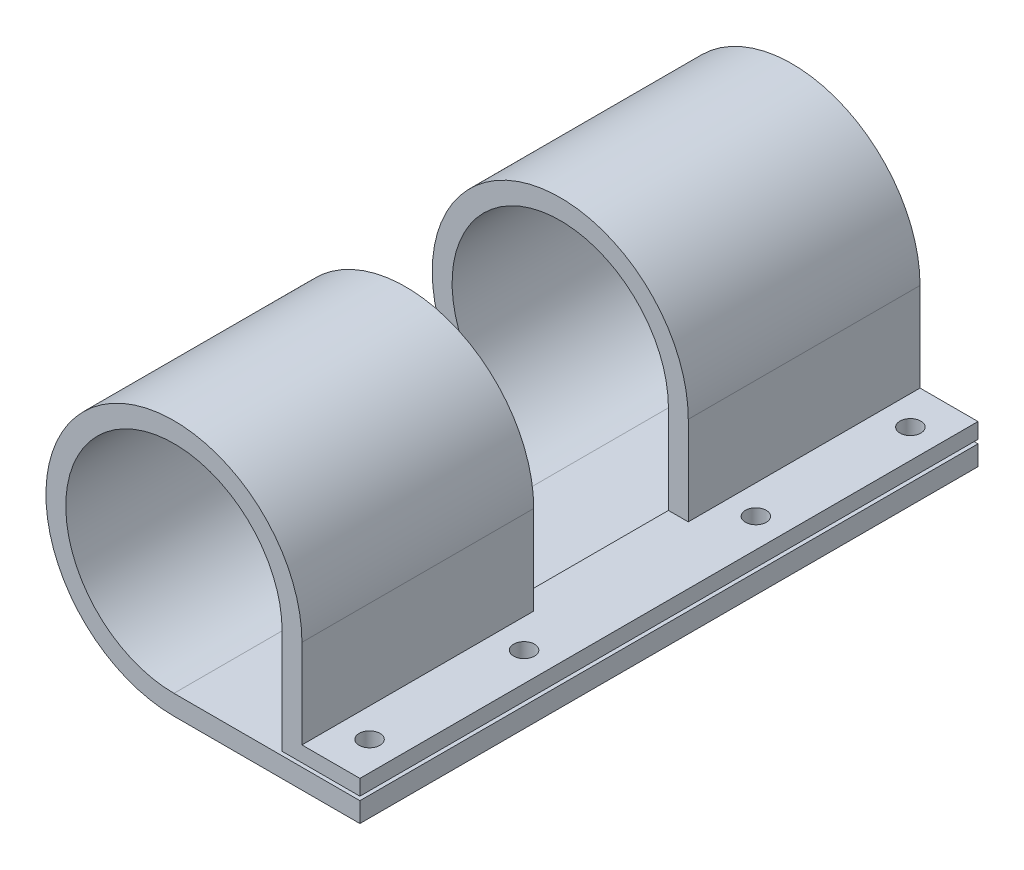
ISO-10303-21;
HEADER;
FILE_DESCRIPTION(('STEP AP214'),'2;1');
FILE_NAME('part.step','',(''),(''),'','','');
FILE_SCHEMA(('AUTOMOTIVE_DESIGN { 1 0 10303 214 1 1 1 1 }'));
ENDSEC;
DATA;
#1=APPLICATION_CONTEXT('core data for automotive mechanical design processes');
#2=APPLICATION_PROTOCOL_DEFINITION('international standard','automotive_design',2000,#1);
#3=PRODUCT_CONTEXT('',#1,'mechanical');
#4=PRODUCT('Part','Part','',(#3));
#5=PRODUCT_RELATED_PRODUCT_CATEGORY('part','',(#4));
#6=PRODUCT_DEFINITION_FORMATION('','',#4);
#7=PRODUCT_DEFINITION_CONTEXT('part definition',#1,'design');
#8=PRODUCT_DEFINITION('design','',#6,#7);
#9=PRODUCT_DEFINITION_SHAPE('','',#8);
#10=(LENGTH_UNIT() NAMED_UNIT(*) SI_UNIT(.MILLI.,.METRE.));
#11=(NAMED_UNIT(*) PLANE_ANGLE_UNIT() SI_UNIT($,.RADIAN.));
#12=(NAMED_UNIT(*) SI_UNIT($,.STERADIAN.) SOLID_ANGLE_UNIT());
#13=UNCERTAINTY_MEASURE_WITH_UNIT(LENGTH_MEASURE(1.E-05),#10,'distance_accuracy_value','');
#14=(GEOMETRIC_REPRESENTATION_CONTEXT(3) GLOBAL_UNCERTAINTY_ASSIGNED_CONTEXT((#13)) GLOBAL_UNIT_ASSIGNED_CONTEXT((#10,
#11,#12)) REPRESENTATION_CONTEXT('',''));
#15=CARTESIAN_POINT('',(0.,0.,0.));
#16=DIRECTION('',(0.,0.,1.));
#17=DIRECTION('',(1.,0.,0.));
#18=AXIS2_PLACEMENT_3D('',#15,#16,#17);
#19=CARTESIAN_POINT('',(21.04,0.,-50.8));
#20=DIRECTION('',(1.,0.,0.));
#21=DIRECTION('',(0.,1.,0.));
#22=AXIS2_PLACEMENT_3D('',#19,#20,#21);
#23=PLANE('',#22);
#24=DIRECTION('',(0.,0.,1.));
#25=VECTOR('',#24,1.);
#26=CARTESIAN_POINT('',(21.04,0.,-50.8));
#27=LINE('',#26,#25);
#28=CARTESIAN_POINT('',(21.04,0.,-50.8));
#29=VERTEX_POINT('',#28);
#30=CARTESIAN_POINT('',(21.04,0.,-12.7));
#31=VERTEX_POINT('',#30);
#32=EDGE_CURVE('E200',#29,#31,#27,.T.);
#33=ORIENTED_EDGE('',*,*,#32,.T.);
#34=DIRECTION('',(0.,-1.,0.));
#35=VECTOR('',#34,1.);
#36=CARTESIAN_POINT('',(21.04,14.605,-12.7));
#37=LINE('',#36,#35);
#38=CARTESIAN_POINT('',(21.04,-14.605,-12.7));
#39=VERTEX_POINT('',#38);
#40=EDGE_CURVE('E187',#31,#39,#37,.T.);
#41=ORIENTED_EDGE('',*,*,#40,.T.);
#42=DIRECTION('',(0.,0.,1.));
#43=VECTOR('',#42,1.);
#44=CARTESIAN_POINT('',(21.04,-14.605,-50.8));
#45=LINE('',#44,#43);
#46=CARTESIAN_POINT('',(21.04,-14.605,-50.8));
#47=VERTEX_POINT('',#46);
#48=EDGE_CURVE('E198',#47,#39,#45,.T.);
#49=ORIENTED_EDGE('',*,*,#48,.F.);
#50=DIRECTION('',(0.,1.,0.));
#51=VECTOR('',#50,1.);
#52=CARTESIAN_POINT('',(21.04,0.,-50.8));
#53=LINE('',#52,#51);
#54=EDGE_CURVE('E309',#47,#29,#53,.T.);
#55=ORIENTED_EDGE('',*,*,#54,.T.);
#56=EDGE_LOOP('',(#33,#41,#49,#55));
#57=FACE_BOUND('',#56,.T.);
#58=ADVANCED_FACE('F69',(#57),#23,.T.);
#59=CARTESIAN_POINT('',(17.78,-17.145,-50.8));
#60=DIRECTION('',(0.,-1.,0.));
#61=DIRECTION('',(0.,0.,-1.));
#62=AXIS2_PLACEMENT_3D('',#59,#60,#61);
#63=PLANE('',#62);
#64=CARTESIAN_POINT('',(25.8025,-17.145,-44.45));
#65=DIRECTION('',(0.,-1.,0.));
#66=DIRECTION('',(0.,0.,-1.));
#67=AXIS2_PLACEMENT_3D('',#64,#65,#66);
#68=CIRCLE('',#67,1.7145);
#69=CARTESIAN_POINT('',(25.8025,-17.145,-46.1645));
#70=VERTEX_POINT('',#69);
#71=EDGE_CURVE('E202',#70,#70,#68,.T.);
#72=ORIENTED_EDGE('',*,*,#71,.F.);
#73=EDGE_LOOP('',(#72));
#74=FACE_BOUND('',#73,.T.);
#75=CARTESIAN_POINT('',(25.8025,-17.145,19.05));
#76=DIRECTION('',(0.,-1.,0.));
#77=DIRECTION('',(0.,0.,-1.));
#78=AXIS2_PLACEMENT_3D('',#75,#76,#77);
#79=CIRCLE('',#78,1.7145);
#80=CARTESIAN_POINT('',(25.8025,-17.145,17.3355));
#81=VERTEX_POINT('',#80);
#82=EDGE_CURVE('E399',#81,#81,#79,.T.);
#83=ORIENTED_EDGE('',*,*,#82,.F.);
#84=EDGE_LOOP('',(#83));
#85=FACE_BOUND('',#84,.T.);
#86=CARTESIAN_POINT('',(25.8025,-17.145,44.45));
#87=DIRECTION('',(0.,-1.,0.));
#88=DIRECTION('',(0.,0.,-1.));
#89=AXIS2_PLACEMENT_3D('',#86,#87,#88);
#90=CIRCLE('',#89,1.7145);
#91=CARTESIAN_POINT('',(25.8025,-17.145,42.7355));
#92=VERTEX_POINT('',#91);
#93=EDGE_CURVE('E411',#92,#92,#90,.T.);
#94=ORIENTED_EDGE('',*,*,#93,.F.);
#95=EDGE_LOOP('',(#94));
#96=FACE_BOUND('',#95,.T.);
#97=CARTESIAN_POINT('',(25.8025,-17.145,-19.05));
#98=DIRECTION('',(0.,-1.,0.));
#99=DIRECTION('',(0.,0.,-1.));
#100=AXIS2_PLACEMENT_3D('',#97,#98,#99);
#101=CIRCLE('',#100,1.7145);
#102=CARTESIAN_POINT('',(25.8025,-17.145,-20.7645));
#103=VERTEX_POINT('',#102);
#104=EDGE_CURVE('E423',#103,#103,#101,.T.);
#105=ORIENTED_EDGE('',*,*,#104,.F.);
#106=EDGE_LOOP('',(#105));
#107=FACE_BOUND('',#106,.T.);
#108=DIRECTION('',(0.,0.,1.));
#109=VECTOR('',#108,1.);
#110=CARTESIAN_POINT('',(30.565,-17.145,-50.8));
#111=LINE('',#110,#109);
#112=CARTESIAN_POINT('',(30.565,-17.145,-50.8));
#113=VERTEX_POINT('',#112);
#114=CARTESIAN_POINT('',(30.565,-17.145,50.8));
#115=VERTEX_POINT('',#114);
#116=EDGE_CURVE('E73',#113,#115,#111,.T.);
#117=ORIENTED_EDGE('',*,*,#116,.T.);
#118=DIRECTION('',(1.,0.,0.));
#119=VECTOR('',#118,1.);
#120=CARTESIAN_POINT('',(17.78,-17.145,50.8));
#121=LINE('',#120,#119);
#122=CARTESIAN_POINT('',(17.78,-17.145,50.8));
#123=VERTEX_POINT('',#122);
#124=EDGE_CURVE('E336',#123,#115,#121,.T.);
#125=ORIENTED_EDGE('',*,*,#124,.F.);
#126=DIRECTION('',(0.,0.,1.));
#127=VECTOR('',#126,1.);
#128=CARTESIAN_POINT('',(17.78,-17.145,-50.8));
#129=LINE('',#128,#127);
#130=CARTESIAN_POINT('',(17.78,-17.145,-50.8));
#131=VERTEX_POINT('',#130);
#132=EDGE_CURVE('E12',#131,#123,#129,.T.);
#133=ORIENTED_EDGE('',*,*,#132,.F.);
#134=DIRECTION('',(1.,0.,0.));
#135=VECTOR('',#134,1.);
#136=CARTESIAN_POINT('',(17.78,-17.145,-50.8));
#137=LINE('',#136,#135);
#138=EDGE_CURVE('E301',#131,#113,#137,.T.);
#139=ORIENTED_EDGE('',*,*,#138,.T.);
#140=EDGE_LOOP('',(#117,#125,#133,#139));
#141=FACE_BOUND('',#140,.T.);
#142=ADVANCED_FACE('F71',(#74,#85,#96,#107,#141),#63,.T.);
#143=CARTESIAN_POINT('',(17.78,0.,-50.8));
#144=DIRECTION('',(-1.,0.,0.));
#145=DIRECTION('',(0.,-1.,0.));
#146=AXIS2_PLACEMENT_3D('',#143,#144,#145);
#147=PLANE('',#146);
#148=DIRECTION('',(0.,1.,0.));
#149=VECTOR('',#148,1.);
#150=CARTESIAN_POINT('',(17.78,0.,12.7));
#151=LINE('',#150,#149);
#152=CARTESIAN_POINT('',(17.78,-14.605,12.7));
#153=VERTEX_POINT('',#152);
#154=CARTESIAN_POINT('',(17.78,0.,12.7));
#155=VERTEX_POINT('',#154);
#156=EDGE_CURVE('E364',#153,#155,#151,.T.);
#157=ORIENTED_EDGE('',*,*,#156,.F.);
#158=DIRECTION('',(0.,0.,1.));
#159=VECTOR('',#158,1.);
#160=CARTESIAN_POINT('',(17.78,-14.605,-50.8));
#161=LINE('',#160,#159);
#162=CARTESIAN_POINT('',(17.78,-14.605,-12.7));
#163=VERTEX_POINT('',#162);
#164=EDGE_CURVE('E352',#163,#153,#161,.T.);
#165=ORIENTED_EDGE('',*,*,#164,.F.);
#166=DIRECTION('',(0.,1.,0.));
#167=VECTOR('',#166,1.);
#168=CARTESIAN_POINT('',(17.78,0.,-12.7));
#169=LINE('',#168,#167);
#170=CARTESIAN_POINT('',(17.78,0.,-12.7));
#171=VERTEX_POINT('',#170);
#172=EDGE_CURVE('E190',#163,#171,#169,.T.);
#173=ORIENTED_EDGE('',*,*,#172,.T.);
#174=DIRECTION('',(0.,0.,1.));
#175=VECTOR('',#174,1.);
#176=CARTESIAN_POINT('',(17.78,0.,-50.8));
#177=LINE('',#176,#175);
#178=CARTESIAN_POINT('',(17.78,0.,-50.8));
#179=VERTEX_POINT('',#178);
#180=EDGE_CURVE('E79',#179,#171,#177,.T.);
#181=ORIENTED_EDGE('',*,*,#180,.F.);
#182=DIRECTION('',(0.,-1.,0.));
#183=VECTOR('',#182,1.);
#184=CARTESIAN_POINT('',(17.78,0.,-50.8));
#185=LINE('',#184,#183);
#186=EDGE_CURVE('E223',#179,#131,#185,.T.);
#187=ORIENTED_EDGE('',*,*,#186,.T.);
#188=ORIENTED_EDGE('',*,*,#132,.T.);
#189=DIRECTION('',(0.,-1.,0.));
#190=VECTOR('',#189,1.);
#191=CARTESIAN_POINT('',(17.78,0.,50.8));
#192=LINE('',#191,#190);
#193=CARTESIAN_POINT('',(17.78,0.,50.8));
#194=VERTEX_POINT('',#193);
#195=EDGE_CURVE('E297',#194,#123,#192,.T.);
#196=ORIENTED_EDGE('',*,*,#195,.F.);
#197=EDGE_CURVE('E242',#155,#194,#177,.T.);
#198=ORIENTED_EDGE('',*,*,#197,.F.);
#199=EDGE_LOOP('',(#157,#165,#173,#181,#187,#188,#196,#198));
#200=FACE_BOUND('',#199,.T.);
#201=ADVANCED_FACE('F339',(#200),#147,.T.);
#202=CARTESIAN_POINT('',(0.,0.,-50.8));
#203=DIRECTION('',(0.,0.,1.));
#204=DIRECTION('',(1.,0.,0.));
#205=AXIS2_PLACEMENT_3D('',#202,#203,#204);
#206=CYLINDRICAL_SURFACE('',#205,17.78);
#207=CARTESIAN_POINT('',(0.,0.,12.7));
#208=DIRECTION('',(0.,0.,1.));
#209=DIRECTION('',(1.,0.,0.));
#210=AXIS2_PLACEMENT_3D('',#207,#208,#209);
#211=CIRCLE('',#210,17.78);
#212=CARTESIAN_POINT('',(-10.1401368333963,-14.605,12.7));
#213=VERTEX_POINT('',#212);
#214=EDGE_CURVE('E367',#155,#213,#211,.T.);
#215=ORIENTED_EDGE('',*,*,#214,.F.);
#216=ORIENTED_EDGE('',*,*,#197,.T.);
#217=CARTESIAN_POINT('',(0.,0.,50.8));
#218=DIRECTION('',(0.,0.,-1.));
#219=DIRECTION('',(1.,0.,0.));
#220=AXIS2_PLACEMENT_3D('',#217,#218,#219);
#221=CIRCLE('',#220,17.78);
#222=CARTESIAN_POINT('',(0.,-17.78,50.8));
#223=VERTEX_POINT('',#222);
#224=EDGE_CURVE('E293',#223,#194,#221,.T.);
#225=ORIENTED_EDGE('',*,*,#224,.F.);
#226=DIRECTION('',(0.,0.,1.));
#227=VECTOR('',#226,1.);
#228=CARTESIAN_POINT('',(0.,-17.78,-50.8));
#229=LINE('',#228,#227);
#230=CARTESIAN_POINT('',(0.,-17.78,-50.8));
#231=VERTEX_POINT('',#230);
#232=EDGE_CURVE('E243',#231,#223,#229,.T.);
#233=ORIENTED_EDGE('',*,*,#232,.F.);
#234=CARTESIAN_POINT('',(0.,0.,-50.8));
#235=DIRECTION('',(0.,0.,-1.));
#236=DIRECTION('',(1.,0.,0.));
#237=AXIS2_PLACEMENT_3D('',#234,#235,#236);
#238=CIRCLE('',#237,17.78);
#239=EDGE_CURVE('E229',#231,#179,#238,.T.);
#240=ORIENTED_EDGE('',*,*,#239,.T.);
#241=ORIENTED_EDGE('',*,*,#180,.T.);
#242=CARTESIAN_POINT('',(0.,0.,-12.7));
#243=DIRECTION('',(0.,0.,1.));
#244=DIRECTION('',(1.,0.,0.));
#245=AXIS2_PLACEMENT_3D('',#242,#243,#244);
#246=CIRCLE('',#245,17.78);
#247=CARTESIAN_POINT('',(-10.1401368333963,-14.605,-12.7));
#248=VERTEX_POINT('',#247);
#249=EDGE_CURVE('E375',#171,#248,#246,.T.);
#250=ORIENTED_EDGE('',*,*,#249,.T.);
#251=DIRECTION('',(0.,0.,1.));
#252=VECTOR('',#251,1.);
#253=CARTESIAN_POINT('',(-10.1401368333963,-14.605,-50.8));
#254=LINE('',#253,#252);
#255=EDGE_CURVE('E358',#213,#248,#254,.F.);
#256=ORIENTED_EDGE('',*,*,#255,.F.);
#257=EDGE_LOOP('',(#215,#216,#225,#233,#240,#241,#250,#256));
#258=FACE_BOUND('',#257,.T.);
#259=ADVANCED_FACE('F332',(#258),#206,.F.);
#260=CARTESIAN_POINT('',(0.,-17.78,-50.8));
#261=DIRECTION('',(0.,1.,0.));
#262=DIRECTION('',(0.,0.,1.));
#263=AXIS2_PLACEMENT_3D('',#260,#261,#262);
#264=PLANE('',#263);
#265=CARTESIAN_POINT('',(25.8025,-17.78,-44.45));
#266=DIRECTION('',(0.,1.,0.));
#267=DIRECTION('',(0.,0.,1.));
#268=AXIS2_PLACEMENT_3D('',#265,#266,#267);
#269=CIRCLE('',#268,1.7145);
#270=CARTESIAN_POINT('',(25.8025,-17.78,-42.7355));
#271=VERTEX_POINT('',#270);
#272=EDGE_CURVE('E391',#271,#271,#269,.T.);
#273=ORIENTED_EDGE('',*,*,#272,.F.);
#274=EDGE_LOOP('',(#273));
#275=FACE_BOUND('',#274,.T.);
#276=CARTESIAN_POINT('',(25.8025,-17.78,19.05));
#277=DIRECTION('',(0.,1.,0.));
#278=DIRECTION('',(0.,0.,1.));
#279=AXIS2_PLACEMENT_3D('',#276,#277,#278);
#280=CIRCLE('',#279,1.7145);
#281=CARTESIAN_POINT('',(25.8025,-17.78,20.7645));
#282=VERTEX_POINT('',#281);
#283=EDGE_CURVE('E403',#282,#282,#280,.T.);
#284=ORIENTED_EDGE('',*,*,#283,.F.);
#285=EDGE_LOOP('',(#284));
#286=FACE_BOUND('',#285,.T.);
#287=CARTESIAN_POINT('',(25.8025,-17.78,44.45));
#288=DIRECTION('',(0.,1.,0.));
#289=DIRECTION('',(0.,0.,1.));
#290=AXIS2_PLACEMENT_3D('',#287,#288,#289);
#291=CIRCLE('',#290,1.7145);
#292=CARTESIAN_POINT('',(25.8025,-17.78,46.1645));
#293=VERTEX_POINT('',#292);
#294=EDGE_CURVE('E415',#293,#293,#291,.T.);
#295=ORIENTED_EDGE('',*,*,#294,.F.);
#296=EDGE_LOOP('',(#295));
#297=FACE_BOUND('',#296,.T.);
#298=CARTESIAN_POINT('',(25.8025,-17.78,-19.05));
#299=DIRECTION('',(0.,1.,0.));
#300=DIRECTION('',(0.,0.,1.));
#301=AXIS2_PLACEMENT_3D('',#298,#299,#300);
#302=CIRCLE('',#301,1.7145);
#303=CARTESIAN_POINT('',(25.8025,-17.78,-17.3355));
#304=VERTEX_POINT('',#303);
#305=EDGE_CURVE('E427',#304,#304,#302,.T.);
#306=ORIENTED_EDGE('',*,*,#305,.F.);
#307=EDGE_LOOP('',(#306));
#308=FACE_BOUND('',#307,.T.);
#309=ORIENTED_EDGE('',*,*,#232,.T.);
#310=DIRECTION('',(-1.,0.,0.));
#311=VECTOR('',#310,1.);
#312=CARTESIAN_POINT('',(18.5,-17.78,50.8));
#313=LINE('',#312,#311);
#314=CARTESIAN_POINT('',(30.565,-17.78,50.8));
#315=VERTEX_POINT('',#314);
#316=EDGE_CURVE('E286',#315,#223,#313,.T.);
#317=ORIENTED_EDGE('',*,*,#316,.F.);
#318=DIRECTION('',(0.,0.,1.));
#319=VECTOR('',#318,1.);
#320=CARTESIAN_POINT('',(30.565,-17.78,-50.8));
#321=LINE('',#320,#319);
#322=CARTESIAN_POINT('',(30.565,-17.78,-50.8));
#323=VERTEX_POINT('',#322);
#324=EDGE_CURVE('E246',#323,#315,#321,.T.);
#325=ORIENTED_EDGE('',*,*,#324,.F.);
#326=DIRECTION('',(-1.,0.,0.));
#327=VECTOR('',#326,1.);
#328=CARTESIAN_POINT('',(18.5,-17.78,-50.8));
#329=LINE('',#328,#327);
#330=EDGE_CURVE('E235',#323,#231,#329,.T.);
#331=ORIENTED_EDGE('',*,*,#330,.T.);
#332=EDGE_LOOP('',(#309,#317,#325,#331));
#333=FACE_BOUND('',#332,.T.);
#334=ADVANCED_FACE('F324',(#275,#286,#297,#308,#333),#264,.T.);
#335=CARTESIAN_POINT('',(30.565,-17.78,-50.8));
#336=DIRECTION('',(1.,0.,0.));
#337=DIRECTION('',(0.,0.,-1.));
#338=AXIS2_PLACEMENT_3D('',#335,#336,#337);
#339=PLANE('',#338);
#340=ORIENTED_EDGE('',*,*,#324,.T.);
#341=DIRECTION('',(0.,1.,0.));
#342=VECTOR('',#341,1.);
#343=CARTESIAN_POINT('',(30.565,-17.78,50.8));
#344=LINE('',#343,#342);
#345=CARTESIAN_POINT('',(30.565,-21.04,50.8));
#346=VERTEX_POINT('',#345);
#347=EDGE_CURVE('E283',#346,#315,#344,.T.);
#348=ORIENTED_EDGE('',*,*,#347,.F.);
#349=DIRECTION('',(0.,0.,1.));
#350=VECTOR('',#349,1.);
#351=CARTESIAN_POINT('',(30.565,-21.04,-50.8));
#352=LINE('',#351,#350);
#353=CARTESIAN_POINT('',(30.565,-21.04,-50.8));
#354=VERTEX_POINT('',#353);
#355=EDGE_CURVE('E249',#354,#346,#352,.T.);
#356=ORIENTED_EDGE('',*,*,#355,.F.);
#357=DIRECTION('',(0.,1.,0.));
#358=VECTOR('',#357,1.);
#359=CARTESIAN_POINT('',(30.565,-17.78,-50.8));
#360=LINE('',#359,#358);
#361=EDGE_CURVE('E317',#354,#323,#360,.T.);
#362=ORIENTED_EDGE('',*,*,#361,.T.);
#363=EDGE_LOOP('',(#340,#348,#356,#362));
#364=FACE_BOUND('',#363,.T.);
#365=ADVANCED_FACE('F342',(#364),#339,.T.);
#366=CARTESIAN_POINT('',(0.,-21.04,-50.8));
#367=DIRECTION('',(0.,-1.,0.));
#368=DIRECTION('',(0.,0.,-1.));
#369=AXIS2_PLACEMENT_3D('',#366,#367,#368);
#370=PLANE('',#369);
#371=CARTESIAN_POINT('',(25.8025,-21.04,-44.45));
#372=DIRECTION('',(0.,-1.,0.));
#373=DIRECTION('',(0.,0.,-1.));
#374=AXIS2_PLACEMENT_3D('',#371,#372,#373);
#375=CIRCLE('',#374,1.7145);
#376=CARTESIAN_POINT('',(25.8025,-21.04,-46.1645));
#377=VERTEX_POINT('',#376);
#378=EDGE_CURVE('E395',#377,#377,#375,.T.);
#379=ORIENTED_EDGE('',*,*,#378,.F.);
#380=EDGE_LOOP('',(#379));
#381=FACE_BOUND('',#380,.T.);
#382=CARTESIAN_POINT('',(25.8025,-21.04,19.05));
#383=DIRECTION('',(0.,-1.,0.));
#384=DIRECTION('',(0.,0.,-1.));
#385=AXIS2_PLACEMENT_3D('',#382,#383,#384);
#386=CIRCLE('',#385,1.7145);
#387=CARTESIAN_POINT('',(25.8025,-21.04,17.3355));
#388=VERTEX_POINT('',#387);
#389=EDGE_CURVE('E407',#388,#388,#386,.T.);
#390=ORIENTED_EDGE('',*,*,#389,.F.);
#391=EDGE_LOOP('',(#390));
#392=FACE_BOUND('',#391,.T.);
#393=CARTESIAN_POINT('',(25.8025,-21.04,44.45));
#394=DIRECTION('',(0.,-1.,0.));
#395=DIRECTION('',(0.,0.,-1.));
#396=AXIS2_PLACEMENT_3D('',#393,#394,#395);
#397=CIRCLE('',#396,1.7145);
#398=CARTESIAN_POINT('',(25.8025,-21.04,42.7355));
#399=VERTEX_POINT('',#398);
#400=EDGE_CURVE('E419',#399,#399,#397,.T.);
#401=ORIENTED_EDGE('',*,*,#400,.F.);
#402=EDGE_LOOP('',(#401));
#403=FACE_BOUND('',#402,.T.);
#404=CARTESIAN_POINT('',(25.8025,-21.04,-19.05));
#405=DIRECTION('',(0.,-1.,0.));
#406=DIRECTION('',(0.,0.,-1.));
#407=AXIS2_PLACEMENT_3D('',#404,#405,#406);
#408=CIRCLE('',#407,1.7145);
#409=CARTESIAN_POINT('',(25.8025,-21.04,-20.7645));
#410=VERTEX_POINT('',#409);
#411=EDGE_CURVE('E431',#410,#410,#408,.T.);
#412=ORIENTED_EDGE('',*,*,#411,.F.);
#413=EDGE_LOOP('',(#412));
#414=FACE_BOUND('',#413,.T.);
#415=ORIENTED_EDGE('',*,*,#355,.T.);
#416=DIRECTION('',(1.,0.,0.));
#417=VECTOR('',#416,1.);
#418=CARTESIAN_POINT('',(0.,-21.04,50.8));
#419=LINE('',#418,#417);
#420=CARTESIAN_POINT('',(0.,-21.04,50.8));
#421=VERTEX_POINT('',#420);
#422=EDGE_CURVE('E274',#421,#346,#419,.T.);
#423=ORIENTED_EDGE('',*,*,#422,.F.);
#424=DIRECTION('',(0.,0.,1.));
#425=VECTOR('',#424,1.);
#426=CARTESIAN_POINT('',(0.,-21.04,-50.8));
#427=LINE('',#426,#425);
#428=CARTESIAN_POINT('',(0.,-21.04,-50.8));
#429=VERTEX_POINT('',#428);
#430=EDGE_CURVE('E251',#429,#421,#427,.T.);
#431=ORIENTED_EDGE('',*,*,#430,.F.);
#432=DIRECTION('',(1.,0.,0.));
#433=VECTOR('',#432,1.);
#434=CARTESIAN_POINT('',(0.,-21.04,-50.8));
#435=LINE('',#434,#433);
#436=EDGE_CURVE('E314',#429,#354,#435,.T.);
#437=ORIENTED_EDGE('',*,*,#436,.T.);
#438=EDGE_LOOP('',(#415,#423,#431,#437));
#439=FACE_BOUND('',#438,.T.);
#440=ADVANCED_FACE('F281',(#381,#392,#403,#414,#439),#370,.T.);
#441=CARTESIAN_POINT('',(0.,0.,-50.8));
#442=DIRECTION('',(0.,0.,1.));
#443=DIRECTION('',(1.,0.,0.));
#444=AXIS2_PLACEMENT_3D('',#441,#442,#443);
#445=CYLINDRICAL_SURFACE('',#444,21.04);
#446=CARTESIAN_POINT('',(0.,0.,12.7));
#447=DIRECTION('',(0.,0.,1.));
#448=DIRECTION('',(1.,0.,0.));
#449=AXIS2_PLACEMENT_3D('',#446,#447,#448);
#450=CIRCLE('',#449,21.04);
#451=CARTESIAN_POINT('',(-15.1451502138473,-14.605,12.7));
#452=VERTEX_POINT('',#451);
#453=CARTESIAN_POINT('',(21.04,0.,12.7));
#454=VERTEX_POINT('',#453);
#455=EDGE_CURVE('E370',#452,#454,#450,.F.);
#456=ORIENTED_EDGE('',*,*,#455,.F.);
#457=DIRECTION('',(0.,0.,1.));
#458=VECTOR('',#457,1.);
#459=CARTESIAN_POINT('',(-15.1451502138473,-14.605,-50.8));
#460=LINE('',#459,#458);
#461=CARTESIAN_POINT('',(-15.1451502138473,-14.605,-12.7));
#462=VERTEX_POINT('',#461);
#463=EDGE_CURVE('E361',#462,#452,#460,.T.);
#464=ORIENTED_EDGE('',*,*,#463,.F.);
#465=CARTESIAN_POINT('',(0.,0.,-12.7));
#466=DIRECTION('',(0.,0.,1.));
#467=DIRECTION('',(1.,0.,0.));
#468=AXIS2_PLACEMENT_3D('',#465,#466,#467);
#469=CIRCLE('',#468,21.04);
#470=EDGE_CURVE('E379',#462,#31,#469,.F.);
#471=ORIENTED_EDGE('',*,*,#470,.T.);
#472=ORIENTED_EDGE('',*,*,#32,.F.);
#473=CARTESIAN_POINT('',(0.,0.,-50.8));
#474=DIRECTION('',(0.,0.,1.));
#475=DIRECTION('',(1.,0.,0.));
#476=AXIS2_PLACEMENT_3D('',#473,#474,#475);
#477=CIRCLE('',#476,21.04);
#478=EDGE_CURVE('E263',#29,#429,#477,.T.);
#479=ORIENTED_EDGE('',*,*,#478,.T.);
#480=ORIENTED_EDGE('',*,*,#430,.T.);
#481=CARTESIAN_POINT('',(0.,0.,50.8));
#482=DIRECTION('',(0.,0.,1.));
#483=DIRECTION('',(1.,0.,0.));
#484=AXIS2_PLACEMENT_3D('',#481,#482,#483);
#485=CIRCLE('',#484,21.04);
#486=CARTESIAN_POINT('',(21.04,0.,50.8));
#487=VERTEX_POINT('',#486);
#488=EDGE_CURVE('E261',#487,#421,#485,.T.);
#489=ORIENTED_EDGE('',*,*,#488,.F.);
#490=EDGE_CURVE('E209',#454,#487,#27,.T.);
#491=ORIENTED_EDGE('',*,*,#490,.F.);
#492=EDGE_LOOP('',(#456,#464,#471,#472,#479,#480,#489,#491));
#493=FACE_BOUND('',#492,.T.);
#494=ADVANCED_FACE('F259',(#493),#445,.T.);
#495=DIRECTION('',(0.,-1.,0.));
#496=VECTOR('',#495,1.);
#497=CARTESIAN_POINT('',(21.04,14.605,12.7));
#498=LINE('',#497,#496);
#499=CARTESIAN_POINT('',(21.04,-14.605,12.7));
#500=VERTEX_POINT('',#499);
#501=EDGE_CURVE('E95',#454,#500,#498,.T.);
#502=ORIENTED_EDGE('',*,*,#501,.F.);
#503=ORIENTED_EDGE('',*,*,#490,.T.);
#504=DIRECTION('',(0.,1.,0.));
#505=VECTOR('',#504,1.);
#506=CARTESIAN_POINT('',(21.04,0.,50.8));
#507=LINE('',#506,#505);
#508=CARTESIAN_POINT('',(21.04,-14.605,50.8));
#509=VERTEX_POINT('',#508);
#510=EDGE_CURVE('E278',#509,#487,#507,.T.);
#511=ORIENTED_EDGE('',*,*,#510,.F.);
#512=EDGE_CURVE('E210',#500,#509,#45,.T.);
#513=ORIENTED_EDGE('',*,*,#512,.F.);
#514=EDGE_LOOP('',(#502,#503,#511,#513));
#515=FACE_BOUND('',#514,.T.);
#516=ADVANCED_FACE('F456',(#515),#23,.T.);
#517=CARTESIAN_POINT('',(21.04,-14.605,-50.8));
#518=DIRECTION('',(0.,1.,0.));
#519=DIRECTION('',(0.,0.,1.));
#520=AXIS2_PLACEMENT_3D('',#517,#518,#519);
#521=PLANE('',#520);
#522=CARTESIAN_POINT('',(25.8025,-14.605,-44.45));
#523=DIRECTION('',(0.,1.,0.));
#524=DIRECTION('',(0.,0.,1.));
#525=AXIS2_PLACEMENT_3D('',#522,#523,#524);
#526=CIRCLE('',#525,1.7145);
#527=CARTESIAN_POINT('',(25.8025,-14.605,-42.7355));
#528=VERTEX_POINT('',#527);
#529=EDGE_CURVE('E435',#528,#528,#526,.T.);
#530=ORIENTED_EDGE('',*,*,#529,.F.);
#531=EDGE_LOOP('',(#530));
#532=FACE_BOUND('',#531,.T.);
#533=CARTESIAN_POINT('',(25.8025,-14.605,19.05));
#534=DIRECTION('',(0.,1.,0.));
#535=DIRECTION('',(0.,0.,1.));
#536=AXIS2_PLACEMENT_3D('',#533,#534,#535);
#537=CIRCLE('',#536,1.7145);
#538=CARTESIAN_POINT('',(25.8025,-14.605,20.7645));
#539=VERTEX_POINT('',#538);
#540=EDGE_CURVE('E441',#539,#539,#537,.T.);
#541=ORIENTED_EDGE('',*,*,#540,.F.);
#542=EDGE_LOOP('',(#541));
#543=FACE_BOUND('',#542,.T.);
#544=CARTESIAN_POINT('',(25.8025,-14.605,44.45));
#545=DIRECTION('',(0.,1.,0.));
#546=DIRECTION('',(0.,0.,1.));
#547=AXIS2_PLACEMENT_3D('',#544,#545,#546);
#548=CIRCLE('',#547,1.7145);
#549=CARTESIAN_POINT('',(25.8025,-14.605,46.1645));
#550=VERTEX_POINT('',#549);
#551=EDGE_CURVE('E436',#550,#550,#548,.T.);
#552=ORIENTED_EDGE('',*,*,#551,.F.);
#553=EDGE_LOOP('',(#552));
#554=FACE_BOUND('',#553,.T.);
#555=CARTESIAN_POINT('',(25.8025,-14.605,-19.05));
#556=DIRECTION('',(0.,1.,0.));
#557=DIRECTION('',(0.,0.,1.));
#558=AXIS2_PLACEMENT_3D('',#555,#556,#557);
#559=CIRCLE('',#558,1.7145);
#560=CARTESIAN_POINT('',(25.8025,-14.605,-17.3355));
#561=VERTEX_POINT('',#560);
#562=EDGE_CURVE('E440',#561,#561,#559,.T.);
#563=ORIENTED_EDGE('',*,*,#562,.F.);
#564=EDGE_LOOP('',(#563));
#565=FACE_BOUND('',#564,.T.);
#566=ORIENTED_EDGE('',*,*,#48,.T.);
#567=DIRECTION('',(1.,0.,0.));
#568=VECTOR('',#567,1.);
#569=CARTESIAN_POINT('',(-29.76,-14.605,-12.7));
#570=LINE('',#569,#568);
#571=EDGE_CURVE('E184',#163,#39,#570,.T.);
#572=ORIENTED_EDGE('',*,*,#571,.F.);
#573=ORIENTED_EDGE('',*,*,#164,.T.);
#574=DIRECTION('',(1.,0.,0.));
#575=VECTOR('',#574,1.);
#576=CARTESIAN_POINT('',(-29.76,-14.605,12.7));
#577=LINE('',#576,#575);
#578=EDGE_CURVE('E383',#153,#500,#577,.T.);
#579=ORIENTED_EDGE('',*,*,#578,.T.);
#580=ORIENTED_EDGE('',*,*,#512,.T.);
#581=DIRECTION('',(-1.,0.,0.));
#582=VECTOR('',#581,1.);
#583=CARTESIAN_POINT('',(21.04,-14.605,50.8));
#584=LINE('',#583,#582);
#585=CARTESIAN_POINT('',(30.565,-14.605,50.8));
#586=VERTEX_POINT('',#585);
#587=EDGE_CURVE('E347',#586,#509,#584,.T.);
#588=ORIENTED_EDGE('',*,*,#587,.F.);
#589=DIRECTION('',(0.,0.,1.));
#590=VECTOR('',#589,1.);
#591=CARTESIAN_POINT('',(30.565,-14.605,-50.8));
#592=LINE('',#591,#590);
#593=CARTESIAN_POINT('',(30.565,-14.605,-50.8));
#594=VERTEX_POINT('',#593);
#595=EDGE_CURVE('E215',#594,#586,#592,.T.);
#596=ORIENTED_EDGE('',*,*,#595,.F.);
#597=DIRECTION('',(-1.,0.,0.));
#598=VECTOR('',#597,1.);
#599=CARTESIAN_POINT('',(21.04,-14.605,-50.8));
#600=LINE('',#599,#598);
#601=EDGE_CURVE('E207',#594,#47,#600,.T.);
#602=ORIENTED_EDGE('',*,*,#601,.T.);
#603=EDGE_LOOP('',(#566,#572,#573,#579,#580,#588,#596,#602));
#604=FACE_BOUND('',#603,.T.);
#605=ADVANCED_FACE('F205',(#532,#543,#554,#565,#604),#521,.T.);
#606=CARTESIAN_POINT('',(30.565,-14.605,-50.8));
#607=DIRECTION('',(1.,0.,0.));
#608=DIRECTION('',(0.,1.,0.));
#609=AXIS2_PLACEMENT_3D('',#606,#607,#608);
#610=PLANE('',#609);
#611=ORIENTED_EDGE('',*,*,#595,.T.);
#612=DIRECTION('',(0.,1.,0.));
#613=VECTOR('',#612,1.);
#614=CARTESIAN_POINT('',(30.565,-14.605,50.8));
#615=LINE('',#614,#613);
#616=EDGE_CURVE('E344',#115,#586,#615,.T.);
#617=ORIENTED_EDGE('',*,*,#616,.F.);
#618=ORIENTED_EDGE('',*,*,#116,.F.);
#619=DIRECTION('',(0.,1.,0.));
#620=VECTOR('',#619,1.);
#621=CARTESIAN_POINT('',(30.565,-14.605,-50.8));
#622=LINE('',#621,#620);
#623=EDGE_CURVE('E304',#113,#594,#622,.T.);
#624=ORIENTED_EDGE('',*,*,#623,.T.);
#625=EDGE_LOOP('',(#611,#617,#618,#624));
#626=FACE_BOUND('',#625,.T.);
#627=ADVANCED_FACE('F343',(#626),#610,.T.);
#628=CARTESIAN_POINT('',(0.,0.,-50.8));
#629=DIRECTION('',(0.,0.,1.));
#630=DIRECTION('',(1.,0.,0.));
#631=AXIS2_PLACEMENT_3D('',#628,#629,#630);
#632=PLANE('',#631);
#633=ORIENTED_EDGE('',*,*,#138,.F.);
#634=ORIENTED_EDGE('',*,*,#186,.F.);
#635=ORIENTED_EDGE('',*,*,#239,.F.);
#636=ORIENTED_EDGE('',*,*,#330,.F.);
#637=ORIENTED_EDGE('',*,*,#361,.F.);
#638=ORIENTED_EDGE('',*,*,#436,.F.);
#639=ORIENTED_EDGE('',*,*,#478,.F.);
#640=ORIENTED_EDGE('',*,*,#54,.F.);
#641=ORIENTED_EDGE('',*,*,#601,.F.);
#642=ORIENTED_EDGE('',*,*,#623,.F.);
#643=EDGE_LOOP('',(#633,#634,#635,#636,#637,#638,#639,#640,#641,#642));
#644=FACE_BOUND('',#643,.T.);
#645=ADVANCED_FACE('F334',(#644),#632,.F.);
#646=CARTESIAN_POINT('',(0.,0.,50.8));
#647=DIRECTION('',(0.,0.,1.));
#648=DIRECTION('',(1.,0.,0.));
#649=AXIS2_PLACEMENT_3D('',#646,#647,#648);
#650=PLANE('',#649);
#651=ORIENTED_EDGE('',*,*,#124,.T.);
#652=ORIENTED_EDGE('',*,*,#616,.T.);
#653=ORIENTED_EDGE('',*,*,#587,.T.);
#654=ORIENTED_EDGE('',*,*,#510,.T.);
#655=ORIENTED_EDGE('',*,*,#488,.T.);
#656=ORIENTED_EDGE('',*,*,#422,.T.);
#657=ORIENTED_EDGE('',*,*,#347,.T.);
#658=ORIENTED_EDGE('',*,*,#316,.T.);
#659=ORIENTED_EDGE('',*,*,#224,.T.);
#660=ORIENTED_EDGE('',*,*,#195,.T.);
#661=EDGE_LOOP('',(#651,#652,#653,#654,#655,#656,#657,#658,#659,#660));
#662=FACE_BOUND('',#661,.T.);
#663=ADVANCED_FACE('F272',(#662),#650,.T.);
#664=CARTESIAN_POINT('',(-29.76,-14.605,12.7));
#665=DIRECTION('',(0.,-1.,0.));
#666=DIRECTION('',(1.,0.,0.));
#667=AXIS2_PLACEMENT_3D('',#664,#665,#666);
#668=PLANE('',#667);
#669=ORIENTED_EDGE('',*,*,#255,.T.);
#670=EDGE_CURVE('E87',#462,#248,#570,.T.);
#671=ORIENTED_EDGE('',*,*,#670,.F.);
#672=ORIENTED_EDGE('',*,*,#463,.T.);
#673=EDGE_CURVE('E381',#452,#213,#577,.T.);
#674=ORIENTED_EDGE('',*,*,#673,.T.);
#675=EDGE_LOOP('',(#669,#671,#672,#674));
#676=FACE_BOUND('',#675,.T.);
#677=ADVANCED_FACE('F506',(#676),#668,.F.);
#678=CARTESIAN_POINT('',(-29.76,14.605,12.7));
#679=DIRECTION('',(0.,0.,1.));
#680=DIRECTION('',(1.,0.,0.));
#681=AXIS2_PLACEMENT_3D('',#678,#679,#680);
#682=PLANE('',#681);
#683=ORIENTED_EDGE('',*,*,#156,.T.);
#684=ORIENTED_EDGE('',*,*,#214,.T.);
#685=ORIENTED_EDGE('',*,*,#673,.F.);
#686=ORIENTED_EDGE('',*,*,#455,.T.);
#687=ORIENTED_EDGE('',*,*,#501,.T.);
#688=ORIENTED_EDGE('',*,*,#578,.F.);
#689=EDGE_LOOP('',(#683,#684,#685,#686,#687,#688));
#690=FACE_BOUND('',#689,.T.);
#691=ADVANCED_FACE('F478',(#690),#682,.F.);
#692=CARTESIAN_POINT('',(-29.76,14.605,-12.7));
#693=DIRECTION('',(0.,0.,1.));
#694=DIRECTION('',(1.,0.,0.));
#695=AXIS2_PLACEMENT_3D('',#692,#693,#694);
#696=PLANE('',#695);
#697=ORIENTED_EDGE('',*,*,#571,.T.);
#698=ORIENTED_EDGE('',*,*,#40,.F.);
#699=ORIENTED_EDGE('',*,*,#470,.F.);
#700=ORIENTED_EDGE('',*,*,#670,.T.);
#701=ORIENTED_EDGE('',*,*,#249,.F.);
#702=ORIENTED_EDGE('',*,*,#172,.F.);
#703=EDGE_LOOP('',(#697,#698,#699,#700,#701,#702));
#704=FACE_BOUND('',#703,.T.);
#705=ADVANCED_FACE('F186',(#704),#696,.T.);
#706=CARTESIAN_POINT('',(25.8025,-65.405,-19.05));
#707=DIRECTION('',(0.,1.,0.));
#708=DIRECTION('',(0.,0.,1.));
#709=AXIS2_PLACEMENT_3D('',#706,#707,#708);
#710=CYLINDRICAL_SURFACE('',#709,1.7145);
#711=ORIENTED_EDGE('',*,*,#104,.T.);
#712=EDGE_LOOP('',(#711));
#713=FACE_BOUND('',#712,.T.);
#714=ORIENTED_EDGE('',*,*,#562,.T.);
#715=EDGE_LOOP('',(#714));
#716=FACE_BOUND('',#715,.T.);
#717=ADVANCED_FACE('F464',(#713,#716),#710,.F.);
#718=CARTESIAN_POINT('',(25.8025,-65.405,44.45));
#719=DIRECTION('',(0.,1.,0.));
#720=DIRECTION('',(0.,0.,1.));
#721=AXIS2_PLACEMENT_3D('',#718,#719,#720);
#722=CYLINDRICAL_SURFACE('',#721,1.7145);
#723=ORIENTED_EDGE('',*,*,#93,.T.);
#724=EDGE_LOOP('',(#723));
#725=FACE_BOUND('',#724,.T.);
#726=ORIENTED_EDGE('',*,*,#551,.T.);
#727=EDGE_LOOP('',(#726));
#728=FACE_BOUND('',#727,.T.);
#729=ADVANCED_FACE('F466',(#725,#728),#722,.F.);
#730=CARTESIAN_POINT('',(25.8025,-65.405,19.05));
#731=DIRECTION('',(0.,1.,0.));
#732=DIRECTION('',(0.,0.,1.));
#733=AXIS2_PLACEMENT_3D('',#730,#731,#732);
#734=CYLINDRICAL_SURFACE('',#733,1.7145);
#735=ORIENTED_EDGE('',*,*,#82,.T.);
#736=EDGE_LOOP('',(#735));
#737=FACE_BOUND('',#736,.T.);
#738=ORIENTED_EDGE('',*,*,#540,.T.);
#739=EDGE_LOOP('',(#738));
#740=FACE_BOUND('',#739,.T.);
#741=ADVANCED_FACE('F473',(#737,#740),#734,.F.);
#742=CARTESIAN_POINT('',(25.8025,-65.405,-44.45));
#743=DIRECTION('',(0.,1.,0.));
#744=DIRECTION('',(0.,0.,1.));
#745=AXIS2_PLACEMENT_3D('',#742,#743,#744);
#746=CYLINDRICAL_SURFACE('',#745,1.7145);
#747=ORIENTED_EDGE('',*,*,#71,.T.);
#748=EDGE_LOOP('',(#747));
#749=FACE_BOUND('',#748,.T.);
#750=ORIENTED_EDGE('',*,*,#529,.T.);
#751=EDGE_LOOP('',(#750));
#752=FACE_BOUND('',#751,.T.);
#753=ADVANCED_FACE('F452',(#749,#752),#746,.F.);
#754=ORIENTED_EDGE('',*,*,#305,.T.);
#755=EDGE_LOOP('',(#754));
#756=FACE_BOUND('',#755,.T.);
#757=ORIENTED_EDGE('',*,*,#411,.T.);
#758=EDGE_LOOP('',(#757));
#759=FACE_BOUND('',#758,.T.);
#760=ADVANCED_FACE('F469',(#756,#759),#710,.F.);
#761=ORIENTED_EDGE('',*,*,#294,.T.);
#762=EDGE_LOOP('',(#761));
#763=FACE_BOUND('',#762,.T.);
#764=ORIENTED_EDGE('',*,*,#400,.T.);
#765=EDGE_LOOP('',(#764));
#766=FACE_BOUND('',#765,.T.);
#767=ADVANCED_FACE('F476',(#763,#766),#722,.F.);
#768=ORIENTED_EDGE('',*,*,#283,.T.);
#769=EDGE_LOOP('',(#768));
#770=FACE_BOUND('',#769,.T.);
#771=ORIENTED_EDGE('',*,*,#389,.T.);
#772=EDGE_LOOP('',(#771));
#773=FACE_BOUND('',#772,.T.);
#774=ADVANCED_FACE('F539',(#770,#773),#734,.F.);
#775=ORIENTED_EDGE('',*,*,#272,.T.);
#776=EDGE_LOOP('',(#775));
#777=FACE_BOUND('',#776,.T.);
#778=ORIENTED_EDGE('',*,*,#378,.T.);
#779=EDGE_LOOP('',(#778));
#780=FACE_BOUND('',#779,.T.);
#781=ADVANCED_FACE('F544',(#777,#780),#746,.F.);
#782=CLOSED_SHELL('',(#58,#142,#201,#259,#334,#365,#440,#494,#516,#605,#627,#645,#663,#677,#691,
#705,#717,#729,#741,#753,#760,#767,#774,#781));
#783=MANIFOLD_SOLID_BREP('B2',#782);
#784=ADVANCED_BREP_SHAPE_REPRESENTATION('',(#18,#783),#14);
#785=SHAPE_DEFINITION_REPRESENTATION(#9,#784);
ENDSEC;
END-ISO-10303-21;
